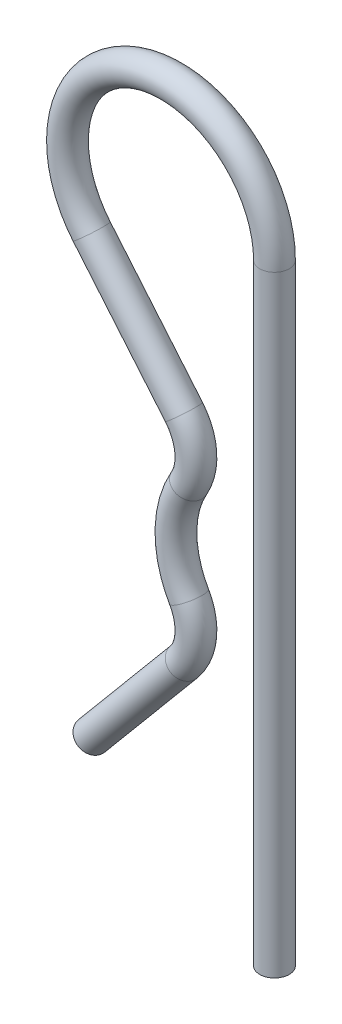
from build123d import *

# Parameters (mm, degrees)
ESQUISSE2_R = 0.75


with BuildPart() as part:
    # Base-Balayage: sweep along a path in Esquisse4
    with BuildLine(Plane.XY) as base_balayage_path:
        Line((0, -16.549113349), (0, 14.450886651))
        ThreePointArc((0, 14.450886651), (-7.042682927, 19.385335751), (-9.275728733, 11.081018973))
        Line((-9.275728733, 11.081018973), (-4.595158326, 5.489491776))
        ThreePointArc((-4.595158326, 5.489491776), (-3.993013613, 4.033364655), (-4.333129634, 2.49479209))
        ThreePointArc((-4.333129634, 2.49479209), (-5, 0), (-4.333129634, -2.49479209))
        ThreePointArc((-4.333129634, -2.49479209), (-3.993013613, -4.033364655), (-4.595158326, -5.489491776))
        Line((-4.595158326, -5.489491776), (-9.275728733, -11.081018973))
    # Esquisse2 → Base-Balayage (sweep)
    with BuildSketch(Plane(origin=(0, -16.549113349, 0), x_dir=(1, 0, 0), z_dir=(0, 1, 0))):
        Circle(ESQUISSE2_R)
    sweep(path=base_balayage_path.line)


solid = part.part
